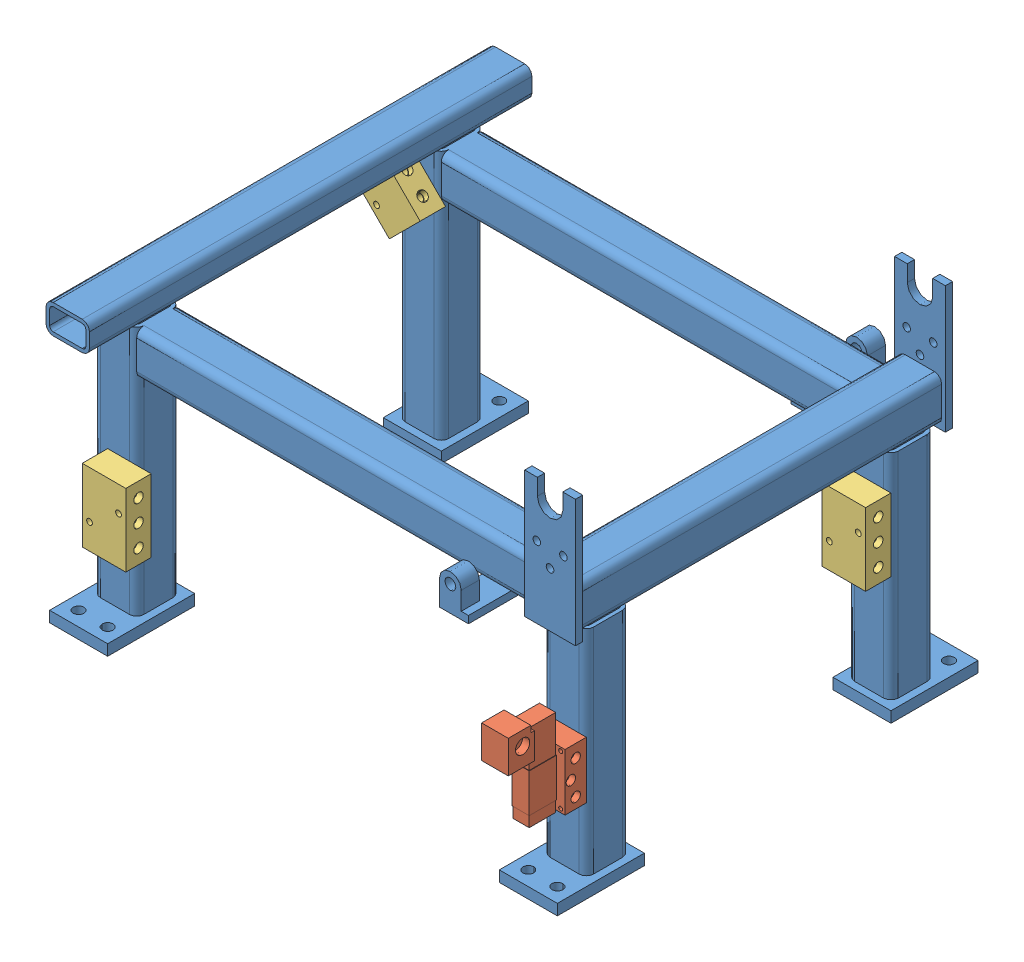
SolidWorks assembly Tubing.SLDASM, configuration Default (file format 13000). Lengths in mm.
Overall size (936.34 609.6 822.45).
8 component instances, 4 part files, 16 mates.
Components (placement in the parent):
- FRAME_8-1: FRAME_8.SLDPRT [Default] at origin size (889 609.6 774.7)
- .375 AIR CONTROL VALVE_p-1: .375 AIR CONTROL VALVE_p.SLDPRT [Default] at (8.382 -402.082 304.8) x (0 -1 0) z (-1 0 0) size (163.07 130.3 59.44)
- manifold_8-1: manifold_8.SLDPRT [Default] at (0 -361.95 -228.6) x (0 1 0) z (0 0 1) size (127 76.2 44.45)
- manifold_8-2: manifold_8.SLDPRT [Default] at (-762 -447.04 304.8) x (0 1 0) z (0 0 1) size (127 76.2 44.45)
- manifold_8-3: manifold_8.SLDPRT [Default] at (-813.7026 -236.0395 -228.6) x (-0.707107 0.707107 0) z (0 0 1) size (127 76.2 44.45)
- Tubing_Clip-3: Tubing_Clip.SLDPRT [4-01 - 6.4mm Dia] at (0 -316.2 225.4) x (0 -1 0) z (1 0 0) size (27.88 8.94 25.42)
- Tubing_Clip-5: Tubing_Clip.SLDPRT [4-01 - 6.4mm Dia] at (0 -379.7 225.4) x (0 -1 0) z (1 0 0) size (27.88 8.94 25.42)
- Tubing_Clip-7: Tubing_Clip.SLDPRT [4-01 - 6.4mm Dia] at (0 -506.7 225.4) x (0 -1 0) z (1 0 0) size (27.88 8.94 25.42)
Mates (geometry in assembly coordinates):
- Coincident1: coincident anti-aligned: plane of FRAME_8-1 through (25.4 -615.95 304.8) normal (0 0 1); plane of .375 AIR CONTROL VALVE_p-1 through (-21.336 -501.65 304.8) normal (0 0 -1)
- Coincident2: coincident aligned: plane of FRAME_8-1 through (38.1 -615.95 292.1) normal (1 0 0); plane of .375 AIR CONTROL VALVE_p-1 through (38.1 -402.082 304.8) normal (1 0 0)
- Distance1: distance = 111.125 mm anti-aligned: plane of FRAME_8-1 through (-50.8 -615.95 215.9) normal (0 1 0); plane of .375 AIR CONTROL VALVE_p-1 through (-5.842 -504.825 342.9) normal (0 -1 0)
- Coincident4: coincident anti-aligned: plane of FRAME_8-1 through (-25.4 -241.3 -228.6) normal (0 0 1); plane of manifold_8-1 through (38.1 -425.45 -228.6) normal (0 0 -1)
- Coincident5: coincident aligned: plane of FRAME_8-1 through (38.1 -241.3 -292.1) normal (1 0 0); plane of manifold_8-1 through (38.1 -425.45 -184.15) normal (1 0 0)
- Distance2: distance = 190.5 mm anti-aligned: plane of FRAME_8-1 through (50.8 -615.95 -215.9) normal (0 1 0); plane of manifold_8-1 through (38.1 -425.45 -184.15) normal (0 -1 0)
- Coincident7: coincident anti-aligned: plane of FRAME_8-1 through (-762 -615.95 304.8) normal (0 0 1); plane of manifold_8-2 through (-723.9 -510.54 304.8) normal (0 0 -1)
- Distance3: distance = 25.4 mm aligned: plane of FRAME_8-1 through (-749.3 -615.95 292.1) normal (1 0 0); plane of manifold_8-2 through (-723.9 -510.54 349.25) normal (1 0 0)
- Distance4: distance = 105.41 mm anti-aligned: plane of FRAME_8-1 through (-838.2 -615.95 215.9) normal (0 1 0); plane of manifold_8-2 through (-723.9 -510.54 349.25) normal (0 -1 0)
- Coincident10: coincident anti-aligned: plane of FRAME_8-1 through (-812.8 -177.8 -228.6) normal (0 0 1); plane of manifold_8-3 through (-741.8605 -254 -228.6) normal (0 0 -1)
- Angle1: planar angle = 2.356194 rad aligned: plane of manifold_8-3 through (-741.8605 -254 -184.15) normal (0.707107 0.707107 0); plane of FRAME_8-1 through (-38.1 -254 -241.3) normal (0 -1 0)
- Tangent1: tangent anti-aligned: cylinder of FRAME_8-1 through (-812.8 -165.1 387.35) axis (0 0 -1) radius 12.7; plane of manifold_8-3 through (-741.8605 -254 -184.15) normal (0.707107 0.707107 0)
- Coincident12: coincident: plane of FRAME_8-1 through (-38.1 -254 -241.3) normal (0 -1 0); line of manifold_8-3 through (-741.8605 -254 -184.15) axis (0 0 -1)
- Concentric51: concentric anti-aligned: cylinder of FRAME_8-1 through (0 -304.8 228.6) axis (0 0 -1) radius 3.175; cylinder of Tubing_Clip-3 through (0 -304.8 219.66) axis (0 0 1) radius 3.175
- Coincident191: coincident anti-aligned: plane of FRAME_8-1 through (-25.4 -615.95 228.6) normal (0 0 -1); plane of Tubing_Clip-3 through (12.7 -313 228.6) normal (0 0 1)
- Parallel1: parallel aligned: plane of FRAME_8-1 through (38.1 -615.95 292.1) normal (1 0 0); plane of Tubing_Clip-3 through (12.7 -299.14 226.06) normal (1 0 0)
